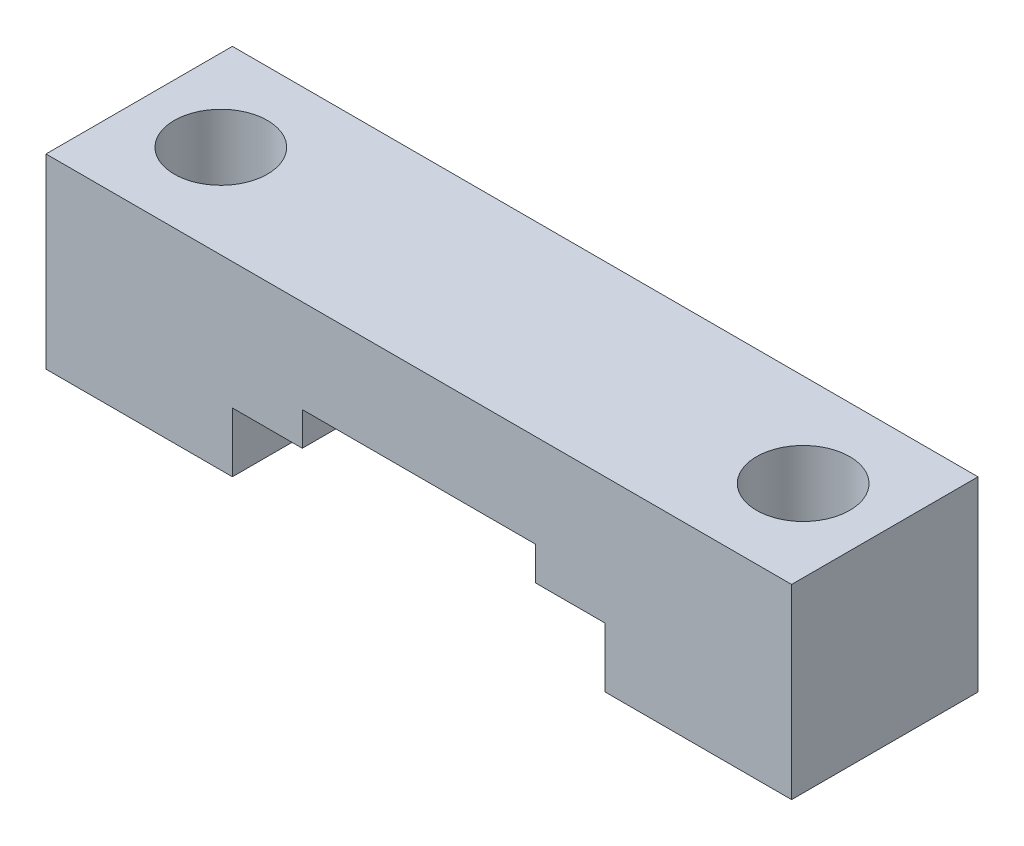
from build123d import *

# Parameters (mm, degrees)
BOSS_EXTRUDE1_DEPTH = 6.35
SKETCH3_R           = 3.175
CUT_EXTRUDE1_DEPTH  = 25.4


with BuildPart() as part:
    # Sketch2 → Boss-Extrude1 (new, symmetric)
    with BuildSketch(Plane.XY):
        Polygon((-12.7, 0), (-25.4, 0), (-25.4, 12.7), (25.4, 12.7), (25.4, 0), (12.7, 0), (12.7, 4.064), (7.9375, 4.064), (7.9375, 6.35), (-7.9375, 6.35), (-7.9375, 4.064), (-12.7, 4.064), align=None)
    extrude(amount=BOSS_EXTRUDE1_DEPTH, both=True)

    # Sketch3 → Cut-Extrude1 (cut)
    with BuildSketch(Plane(origin=(0, 0, 0), x_dir=(1, 0, 0), z_dir=(0, 1, 0))):
        with Locations(Location((-19.8374, 0, 0), (0, 0, 90))):
            Circle(SKETCH3_R)
        with Locations(Location((19.8374, 0, 0), (0, 0, 90))):
            Circle(SKETCH3_R)
    extrude(amount=CUT_EXTRUDE1_DEPTH, mode=Mode.SUBTRACT)


solid = part.part
